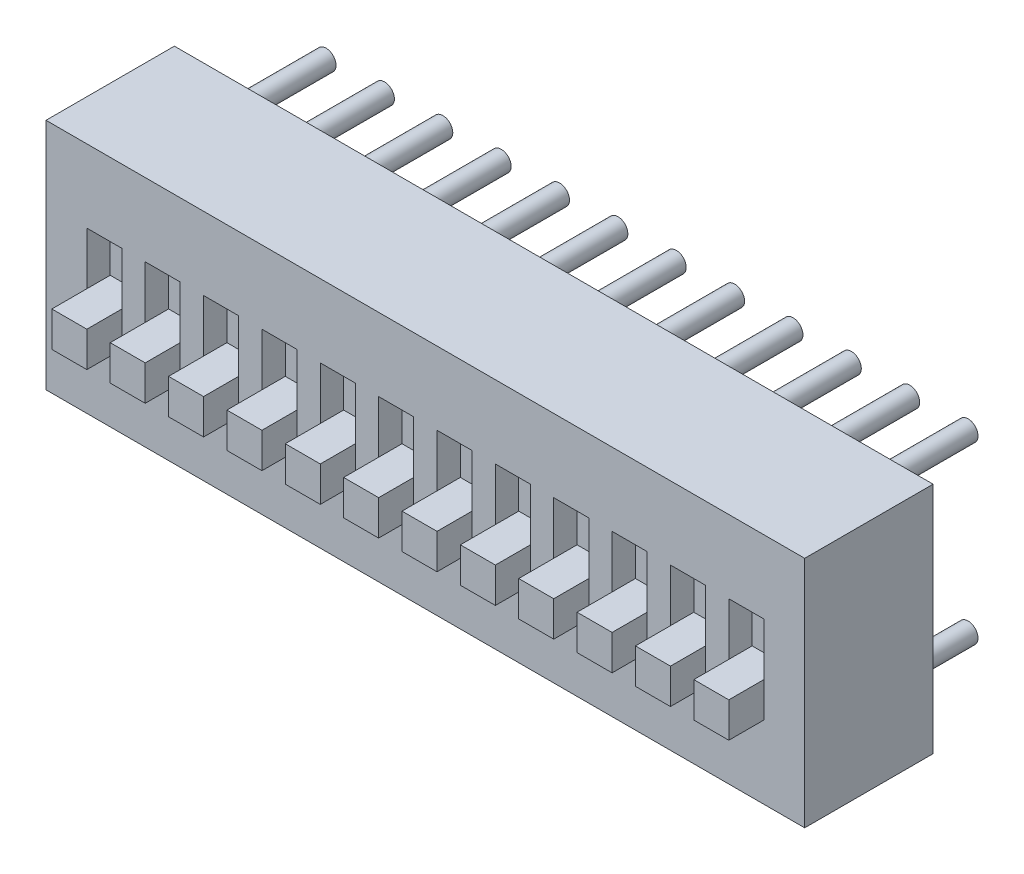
from build123d import *

# Parameters (mm, degrees)
SKETCH1_W              = 33.02
SKETCH1_H              = 10.16
BOSS_EXTRUDE1_DEPTH    = 5.588
SKETCH2_W              = 1.524
SKETCH2_H              = 3.81
CUT_EXTRUDE1_DEPTH     = 1.016
SKETCH3_W              = 1.524
SKETCH3_H              = 1.524
BOSS_EXTRUDE2_DEPTH    = 2.54
BOSS_EXTRUDE2_2_DEPTH  = 2.54
BOSS_EXTRUDE2_3_DEPTH  = 2.54
BOSS_EXTRUDE2_4_DEPTH  = 2.54
BOSS_EXTRUDE2_5_DEPTH  = 2.54
BOSS_EXTRUDE2_6_DEPTH  = 2.54
BOSS_EXTRUDE2_7_DEPTH  = 2.54
BOSS_EXTRUDE2_8_DEPTH  = 2.54
BOSS_EXTRUDE2_9_DEPTH  = 2.54
BOSS_EXTRUDE2_10_DEPTH = 2.54
BOSS_EXTRUDE2_11_DEPTH = 2.54
BOSS_EXTRUDE2_12_DEPTH = 2.54
SKETCH4_R              = 0.4318
BOSS_EXTRUDE3_DEPTH    = 4.064
BOSS_EXTRUDE3_2_DEPTH  = 4.064
BOSS_EXTRUDE3_3_DEPTH  = 4.064
BOSS_EXTRUDE3_4_DEPTH  = 4.064
BOSS_EXTRUDE3_5_DEPTH  = 4.064
BOSS_EXTRUDE3_6_DEPTH  = 4.064
BOSS_EXTRUDE3_7_DEPTH  = 4.064
BOSS_EXTRUDE3_8_DEPTH  = 4.064
BOSS_EXTRUDE3_9_DEPTH  = 4.064
BOSS_EXTRUDE3_10_DEPTH = 4.064
BOSS_EXTRUDE3_11_DEPTH = 4.064
BOSS_EXTRUDE3_12_DEPTH = 4.064
BOSS_EXTRUDE3_13_DEPTH = 4.064
BOSS_EXTRUDE3_14_DEPTH = 4.064
BOSS_EXTRUDE3_15_DEPTH = 4.064
BOSS_EXTRUDE3_16_DEPTH = 4.064
BOSS_EXTRUDE3_17_DEPTH = 4.064
BOSS_EXTRUDE3_18_DEPTH = 4.064
BOSS_EXTRUDE3_19_DEPTH = 4.064
BOSS_EXTRUDE3_20_DEPTH = 4.064
BOSS_EXTRUDE3_21_DEPTH = 4.064
BOSS_EXTRUDE3_22_DEPTH = 4.064
BOSS_EXTRUDE3_23_DEPTH = 4.064
BOSS_EXTRUDE3_24_DEPTH = 4.064


with BuildPart() as part:
    # Sketch1 → Boss-Extrude1 (new body)
    with BuildSketch(Plane.XY):
        with Locations((13.97, 0)):
            Rectangle(SKETCH1_W, SKETCH1_H)
    extrude(amount=BOSS_EXTRUDE1_DEPTH)

    # Sketch2 → Cut-Extrude1 (cut)
    with BuildSketch(Plane.XY.offset(5.588)):
        Rectangle(SKETCH2_W, SKETCH2_H)
        with Locations((2.54, 0)):
            Rectangle(SKETCH2_W, SKETCH2_H)
        with Locations((5.08, 0)):
            Rectangle(SKETCH2_W, SKETCH2_H)
        with Locations((7.62, 0)):
            Rectangle(SKETCH2_W, SKETCH2_H)
        with Locations((10.16, 0)):
            Rectangle(SKETCH2_W, SKETCH2_H)
        with Locations((12.7, 0)):
            Rectangle(SKETCH2_W, SKETCH2_H)
        with Locations((15.24, 0)):
            Rectangle(SKETCH2_W, SKETCH2_H)
        with Locations((17.78, 0)):
            Rectangle(SKETCH2_W, SKETCH2_H)
        with Locations((20.32, 0)):
            Rectangle(SKETCH2_W, SKETCH2_H)
        with Locations((22.86, 0)):
            Rectangle(SKETCH2_W, SKETCH2_H)
        with Locations((25.4, 0)):
            Rectangle(SKETCH2_W, SKETCH2_H)
        with Locations((27.94, 0)):
            Rectangle(SKETCH2_W, SKETCH2_H)
    extrude(amount=-CUT_EXTRUDE1_DEPTH, mode=Mode.SUBTRACT)


with BuildPart() as body_2:
    # Sketch3 → Boss-Extrude2 (new body)
    with BuildSketch(Plane.XY.offset(4.572)):
        with Locations((0, -1.143)):
            Rectangle(SKETCH3_W, SKETCH3_H)
    extrude(amount=BOSS_EXTRUDE2_DEPTH)


with BuildPart() as body_3:
    # Sketch3 → Boss-Extrude2 2 (new body)
    with BuildSketch(Plane.XY.offset(4.572)):
        with Locations((2.54, -1.143)):
            Rectangle(SKETCH3_W, SKETCH3_H)
    extrude(amount=BOSS_EXTRUDE2_2_DEPTH)


with BuildPart() as body_4:
    # Sketch3 → Boss-Extrude2 3 (new body)
    with BuildSketch(Plane.XY.offset(4.572)):
        with Locations((5.08, -1.143)):
            Rectangle(SKETCH3_W, SKETCH3_H)
    extrude(amount=BOSS_EXTRUDE2_3_DEPTH)


with BuildPart() as body_5:
    # Sketch3 → Boss-Extrude2 4 (new body)
    with BuildSketch(Plane.XY.offset(4.572)):
        with Locations((7.62, -1.143)):
            Rectangle(SKETCH3_W, SKETCH3_H)
    extrude(amount=BOSS_EXTRUDE2_4_DEPTH)


with BuildPart() as body_6:
    # Sketch3 → Boss-Extrude2 5 (new body)
    with BuildSketch(Plane.XY.offset(4.572)):
        with Locations((10.16, -1.143)):
            Rectangle(SKETCH3_W, SKETCH3_H)
    extrude(amount=BOSS_EXTRUDE2_5_DEPTH)


with BuildPart() as body_7:
    # Sketch3 → Boss-Extrude2 6 (new body)
    with BuildSketch(Plane.XY.offset(4.572)):
        with Locations((12.7, -1.143)):
            Rectangle(SKETCH3_W, SKETCH3_H)
    extrude(amount=BOSS_EXTRUDE2_6_DEPTH)


with BuildPart() as body_8:
    # Sketch3 → Boss-Extrude2 7 (new body)
    with BuildSketch(Plane.XY.offset(4.572)):
        with Locations((15.24, -1.143)):
            Rectangle(SKETCH3_W, SKETCH3_H)
    extrude(amount=BOSS_EXTRUDE2_7_DEPTH)


with BuildPart() as body_9:
    # Sketch3 → Boss-Extrude2 8 (new body)
    with BuildSketch(Plane.XY.offset(4.572)):
        with Locations((17.78, -1.143)):
            Rectangle(SKETCH3_W, SKETCH3_H)
    extrude(amount=BOSS_EXTRUDE2_8_DEPTH)


with BuildPart() as body_10:
    # Sketch3 → Boss-Extrude2 9 (new body)
    with BuildSketch(Plane.XY.offset(4.572)):
        with Locations((20.32, -1.143)):
            Rectangle(SKETCH3_W, SKETCH3_H)
    extrude(amount=BOSS_EXTRUDE2_9_DEPTH)


with BuildPart() as body_11:
    # Sketch3 → Boss-Extrude2 10 (new body)
    with BuildSketch(Plane.XY.offset(4.572)):
        with Locations((22.86, -1.143)):
            Rectangle(SKETCH3_W, SKETCH3_H)
    extrude(amount=BOSS_EXTRUDE2_10_DEPTH)


with BuildPart() as body_12:
    # Sketch3 → Boss-Extrude2 11 (new body)
    with BuildSketch(Plane.XY.offset(4.572)):
        with Locations((25.4, -1.143)):
            Rectangle(SKETCH3_W, SKETCH3_H)
    extrude(amount=BOSS_EXTRUDE2_11_DEPTH)


with BuildPart() as body_13:
    # Sketch3 → Boss-Extrude2 12 (new body)
    with BuildSketch(Plane.XY.offset(4.572)):
        with Locations((27.94, -1.143)):
            Rectangle(SKETCH3_W, SKETCH3_H)
    extrude(amount=BOSS_EXTRUDE2_12_DEPTH)


with BuildPart() as body_14:
    # Sketch4 → Boss-Extrude3 (new body)
    with BuildSketch(Plane(origin=(0, 0, 0), x_dir=(-1, 0, 0), z_dir=(0, 0, -1))):
        with Locations((0, 3.81)):
            Circle(SKETCH4_R)
    extrude(amount=BOSS_EXTRUDE3_DEPTH)


with BuildPart() as body_15:
    # Sketch4 → Boss-Extrude3 2 (new body)
    with BuildSketch(Plane(origin=(0, 0, 0), x_dir=(-1, 0, 0), z_dir=(0, 0, -1))):
        with Locations((0, -3.81)):
            Circle(SKETCH4_R)
    extrude(amount=BOSS_EXTRUDE3_2_DEPTH)


with BuildPart() as body_16:
    # Sketch4 → Boss-Extrude3 3 (new body)
    with BuildSketch(Plane(origin=(0, 0, 0), x_dir=(-1, 0, 0), z_dir=(0, 0, -1))):
        with Locations((-2.54, -3.81)):
            Circle(SKETCH4_R)
    extrude(amount=BOSS_EXTRUDE3_3_DEPTH)


with BuildPart() as body_17:
    # Sketch4 → Boss-Extrude3 4 (new body)
    with BuildSketch(Plane(origin=(0, 0, 0), x_dir=(-1, 0, 0), z_dir=(0, 0, -1))):
        with Locations((-5.08, -3.81)):
            Circle(SKETCH4_R)
    extrude(amount=BOSS_EXTRUDE3_4_DEPTH)


with BuildPart() as body_18:
    # Sketch4 → Boss-Extrude3 5 (new body)
    with BuildSketch(Plane(origin=(0, 0, 0), x_dir=(-1, 0, 0), z_dir=(0, 0, -1))):
        with Locations((-7.62, -3.81)):
            Circle(SKETCH4_R)
    extrude(amount=BOSS_EXTRUDE3_5_DEPTH)


with BuildPart() as body_19:
    # Sketch4 → Boss-Extrude3 6 (new body)
    with BuildSketch(Plane(origin=(0, 0, 0), x_dir=(-1, 0, 0), z_dir=(0, 0, -1))):
        with Locations((-10.16, -3.81)):
            Circle(SKETCH4_R)
    extrude(amount=BOSS_EXTRUDE3_6_DEPTH)


with BuildPart() as body_20:
    # Sketch4 → Boss-Extrude3 7 (new body)
    with BuildSketch(Plane(origin=(0, 0, 0), x_dir=(-1, 0, 0), z_dir=(0, 0, -1))):
        with Locations((-12.7, -3.81)):
            Circle(SKETCH4_R)
    extrude(amount=BOSS_EXTRUDE3_7_DEPTH)


with BuildPart() as body_21:
    # Sketch4 → Boss-Extrude3 8 (new body)
    with BuildSketch(Plane(origin=(0, 0, 0), x_dir=(-1, 0, 0), z_dir=(0, 0, -1))):
        with Locations((-15.24, -3.81)):
            Circle(SKETCH4_R)
    extrude(amount=BOSS_EXTRUDE3_8_DEPTH)


with BuildPart() as body_22:
    # Sketch4 → Boss-Extrude3 9 (new body)
    with BuildSketch(Plane(origin=(0, 0, 0), x_dir=(-1, 0, 0), z_dir=(0, 0, -1))):
        with Locations((-17.78, -3.81)):
            Circle(SKETCH4_R)
    extrude(amount=BOSS_EXTRUDE3_9_DEPTH)


with BuildPart() as body_23:
    # Sketch4 → Boss-Extrude3 10 (new body)
    with BuildSketch(Plane(origin=(0, 0, 0), x_dir=(-1, 0, 0), z_dir=(0, 0, -1))):
        with Locations((-20.32, -3.81)):
            Circle(SKETCH4_R)
    extrude(amount=BOSS_EXTRUDE3_10_DEPTH)


with BuildPart() as body_24:
    # Sketch4 → Boss-Extrude3 11 (new body)
    with BuildSketch(Plane(origin=(0, 0, 0), x_dir=(-1, 0, 0), z_dir=(0, 0, -1))):
        with Locations((-22.86, -3.81)):
            Circle(SKETCH4_R)
    extrude(amount=BOSS_EXTRUDE3_11_DEPTH)


with BuildPart() as body_25:
    # Sketch4 → Boss-Extrude3 12 (new body)
    with BuildSketch(Plane(origin=(0, 0, 0), x_dir=(-1, 0, 0), z_dir=(0, 0, -1))):
        with Locations((-25.4, -3.81)):
            Circle(SKETCH4_R)
    extrude(amount=BOSS_EXTRUDE3_12_DEPTH)


with BuildPart() as body_26:
    # Sketch4 → Boss-Extrude3 13 (new body)
    with BuildSketch(Plane(origin=(0, 0, 0), x_dir=(-1, 0, 0), z_dir=(0, 0, -1))):
        with Locations((-27.94, -3.81)):
            Circle(SKETCH4_R)
    extrude(amount=BOSS_EXTRUDE3_13_DEPTH)


with BuildPart() as body_27:
    # Sketch4 → Boss-Extrude3 14 (new body)
    with BuildSketch(Plane(origin=(0, 0, 0), x_dir=(-1, 0, 0), z_dir=(0, 0, -1))):
        with Locations((-2.54, 3.81)):
            Circle(SKETCH4_R)
    extrude(amount=BOSS_EXTRUDE3_14_DEPTH)


with BuildPart() as body_28:
    # Sketch4 → Boss-Extrude3 15 (new body)
    with BuildSketch(Plane(origin=(0, 0, 0), x_dir=(-1, 0, 0), z_dir=(0, 0, -1))):
        with Locations((-5.08, 3.81)):
            Circle(SKETCH4_R)
    extrude(amount=BOSS_EXTRUDE3_15_DEPTH)


with BuildPart() as body_29:
    # Sketch4 → Boss-Extrude3 16 (new body)
    with BuildSketch(Plane(origin=(0, 0, 0), x_dir=(-1, 0, 0), z_dir=(0, 0, -1))):
        with Locations((-7.62, 3.81)):
            Circle(SKETCH4_R)
    extrude(amount=BOSS_EXTRUDE3_16_DEPTH)


with BuildPart() as body_30:
    # Sketch4 → Boss-Extrude3 17 (new body)
    with BuildSketch(Plane(origin=(0, 0, 0), x_dir=(-1, 0, 0), z_dir=(0, 0, -1))):
        with Locations((-10.16, 3.81)):
            Circle(SKETCH4_R)
    extrude(amount=BOSS_EXTRUDE3_17_DEPTH)


with BuildPart() as body_31:
    # Sketch4 → Boss-Extrude3 18 (new body)
    with BuildSketch(Plane(origin=(0, 0, 0), x_dir=(-1, 0, 0), z_dir=(0, 0, -1))):
        with Locations((-12.7, 3.81)):
            Circle(SKETCH4_R)
    extrude(amount=BOSS_EXTRUDE3_18_DEPTH)


with BuildPart() as body_32:
    # Sketch4 → Boss-Extrude3 19 (new body)
    with BuildSketch(Plane(origin=(0, 0, 0), x_dir=(-1, 0, 0), z_dir=(0, 0, -1))):
        with Locations((-15.24, 3.81)):
            Circle(SKETCH4_R)
    extrude(amount=BOSS_EXTRUDE3_19_DEPTH)


with BuildPart() as body_33:
    # Sketch4 → Boss-Extrude3 20 (new body)
    with BuildSketch(Plane(origin=(0, 0, 0), x_dir=(-1, 0, 0), z_dir=(0, 0, -1))):
        with Locations((-17.78, 3.81)):
            Circle(SKETCH4_R)
    extrude(amount=BOSS_EXTRUDE3_20_DEPTH)


with BuildPart() as body_34:
    # Sketch4 → Boss-Extrude3 21 (new body)
    with BuildSketch(Plane(origin=(0, 0, 0), x_dir=(-1, 0, 0), z_dir=(0, 0, -1))):
        with Locations((-20.32, 3.81)):
            Circle(SKETCH4_R)
    extrude(amount=BOSS_EXTRUDE3_21_DEPTH)


with BuildPart() as body_35:
    # Sketch4 → Boss-Extrude3 22 (new body)
    with BuildSketch(Plane(origin=(0, 0, 0), x_dir=(-1, 0, 0), z_dir=(0, 0, -1))):
        with Locations((-22.86, 3.81)):
            Circle(SKETCH4_R)
    extrude(amount=BOSS_EXTRUDE3_22_DEPTH)


with BuildPart() as body_36:
    # Sketch4 → Boss-Extrude3 23 (new body)
    with BuildSketch(Plane(origin=(0, 0, 0), x_dir=(-1, 0, 0), z_dir=(0, 0, -1))):
        with Locations((-25.4, 3.81)):
            Circle(SKETCH4_R)
    extrude(amount=BOSS_EXTRUDE3_23_DEPTH)


with BuildPart() as body_37:
    # Sketch4 → Boss-Extrude3 24 (new body)
    with BuildSketch(Plane(origin=(0, 0, 0), x_dir=(-1, 0, 0), z_dir=(0, 0, -1))):
        with Locations((-27.94, 3.81)):
            Circle(SKETCH4_R)
    extrude(amount=BOSS_EXTRUDE3_24_DEPTH)


solid = Compound([part.part, body_2.part, body_3.part, body_4.part, body_5.part, body_6.part, body_7.part, body_8.part, body_9.part, body_10.part, body_11.part, body_12.part, body_13.part, body_14.part, body_15.part, body_16.part, body_17.part, body_18.part, body_19.part, body_20.part, body_21.part, body_22.part, body_23.part, body_24.part, body_25.part, body_26.part, body_27.part, body_28.part, body_29.part, body_30.part, body_31.part, body_32.part, body_33.part, body_34.part, body_35.part, body_36.part, body_37.part])
